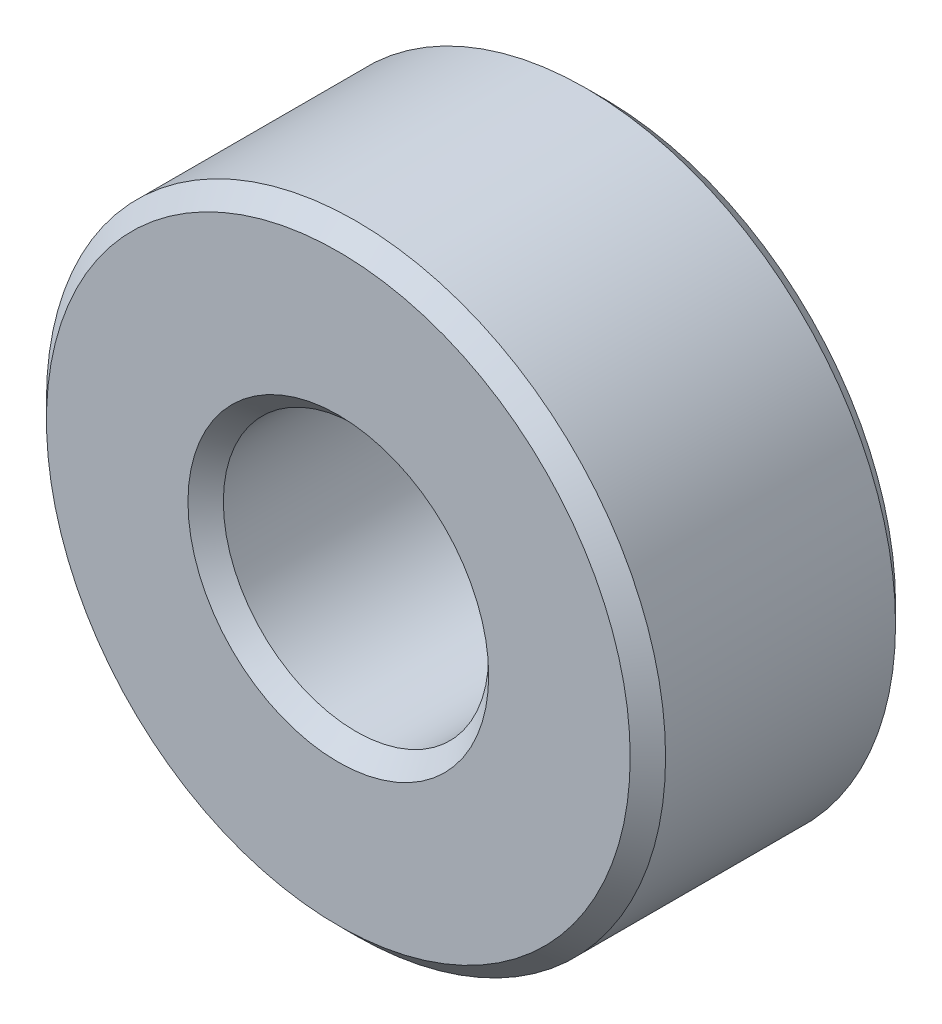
from build123d import *

# Parameters (mm, degrees)
ESQUISSE1_R            = 3.5
ESQUISSE1_R_2          = 1.5
CYLINDRE_DE_BASE_DEPTH = 1.5
CHANFREIN1_SIZE        = 0.2


with BuildPart() as part:
    # Esquisse1 → Cylindre de base (new, symmetric)
    with BuildSketch(Plane.XY):
        Circle(ESQUISSE1_R)
        Circle(ESQUISSE1_R_2, mode=Mode.SUBTRACT)
    extrude(amount=CYLINDRE_DE_BASE_DEPTH, both=True)

    # Chanfrein1
    chanfrein1_edges = [part.edges().sort_by_distance(p)[0] for p in [
        (-3.5, 0, -1.5),
        (-3.5, 0, 1.5),
        (-1.5, 0, 1.5),
        (-1.5, 0, -1.5),
    ]]
    chamfer(chanfrein1_edges, length=CHANFREIN1_SIZE)


solid = part.part
